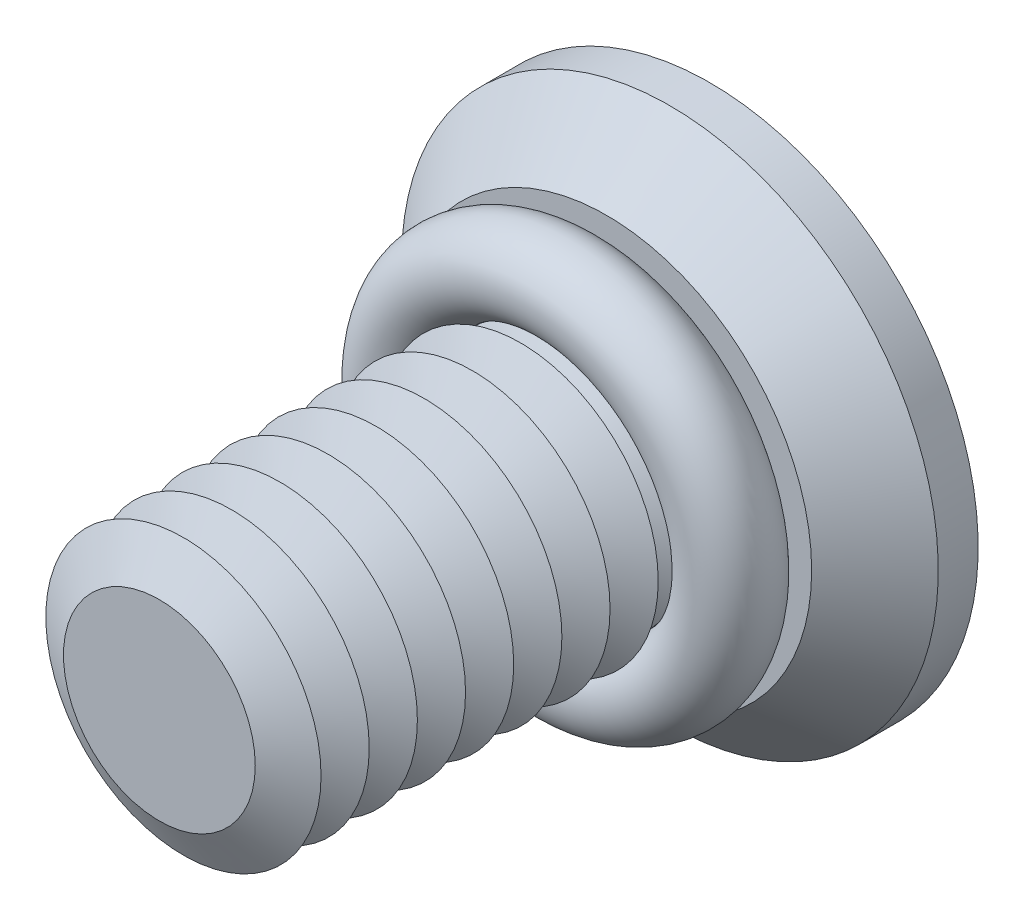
ISO-10303-21;
HEADER;
FILE_DESCRIPTION(('STEP AP214'),'2;1');
FILE_NAME('part.step','',(''),(''),'','','');
FILE_SCHEMA(('AUTOMOTIVE_DESIGN { 1 0 10303 214 1 1 1 1 }'));
ENDSEC;
DATA;
#1=APPLICATION_CONTEXT('core data for automotive mechanical design processes');
#2=APPLICATION_PROTOCOL_DEFINITION('international standard','automotive_design',2000,#1);
#3=PRODUCT_CONTEXT('',#1,'mechanical');
#4=PRODUCT('Part','Part','',(#3));
#5=PRODUCT_RELATED_PRODUCT_CATEGORY('part','',(#4));
#6=PRODUCT_DEFINITION_FORMATION('','',#4);
#7=PRODUCT_DEFINITION_CONTEXT('part definition',#1,'design');
#8=PRODUCT_DEFINITION('design','',#6,#7);
#9=PRODUCT_DEFINITION_SHAPE('','',#8);
#10=(LENGTH_UNIT() NAMED_UNIT(*) SI_UNIT(.MILLI.,.METRE.));
#11=(NAMED_UNIT(*) PLANE_ANGLE_UNIT() SI_UNIT($,.RADIAN.));
#12=(NAMED_UNIT(*) SI_UNIT($,.STERADIAN.) SOLID_ANGLE_UNIT());
#13=UNCERTAINTY_MEASURE_WITH_UNIT(LENGTH_MEASURE(1.E-05),#10,'distance_accuracy_value','');
#14=(GEOMETRIC_REPRESENTATION_CONTEXT(3) GLOBAL_UNCERTAINTY_ASSIGNED_CONTEXT((#13)) GLOBAL_UNIT_ASSIGNED_CONTEXT((#10,
#11,#12)) REPRESENTATION_CONTEXT('',''));
#15=CARTESIAN_POINT('',(0.,0.,0.));
#16=DIRECTION('',(0.,0.,1.));
#17=DIRECTION('',(1.,0.,0.));
#18=AXIS2_PLACEMENT_3D('',#15,#16,#17);
#19=CARTESIAN_POINT('',(0.,0.,2.1));
#20=DIRECTION('',(0.,0.,1.));
#21=DIRECTION('',(1.,0.,0.));
#22=AXIS2_PLACEMENT_3D('',#19,#20,#21);
#23=TOROIDAL_SURFACE('',#22,2.4,0.6);
#24=CARTESIAN_POINT('',(0.,2.4,2.1));
#25=DIRECTION('',(1.,0.,0.));
#26=DIRECTION('',(0.,0.,-1.));
#27=AXIS2_PLACEMENT_3D('',#24,#25,#26);
#28=CIRCLE('',#27,0.6);
#29=CARTESIAN_POINT('',(0.,3.,2.1));
#30=VERTEX_POINT('',#29);
#31=EDGE_CURVE('P0_E10',#30,#30,#28,.T.);
#32=CARTESIAN_POINT('',(0.,0.,2.1));
#33=DIRECTION('',(0.,0.,1.));
#34=DIRECTION('',(1.,0.,0.));
#35=AXIS2_PLACEMENT_3D('',#32,#33,#34);
#36=CIRCLE('',#35,3.);
#37=EDGE_CURVE('',#30,#30,#36,.T.);
#38=ORIENTED_EDGE('',*,*,#31,.F.);
#39=ORIENTED_EDGE('',*,*,#31,.T.);
#40=ORIENTED_EDGE('',*,*,#37,.T.);
#41=ORIENTED_EDGE('',*,*,#37,.F.);
#42=EDGE_LOOP('',(#38,#40,#39,#41));
#43=FACE_BOUND('',#42,.T.);
#44=ADVANCED_FACE('P0_F14',(#43),#23,.T.);
#45=CLOSED_SHELL('',(#44));
#46=MANIFOLD_SOLID_BREP('P0_B1',#45);
#47=CARTESIAN_POINT('',(0.,0.,4.5));
#48=DIRECTION('',(0.,0.,-1.));
#49=DIRECTION('',(-1.,0.,0.));
#50=AXIS2_PLACEMENT_3D('',#47,#48,#49);
#51=CONICAL_SURFACE('',#50,1.39378221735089,1.0471975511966);
#52=CARTESIAN_POINT('',(0.,0.,4.15));
#53=DIRECTION('',(0.,0.,1.));
#54=DIRECTION('',(1.,0.,0.));
#55=AXIS2_PLACEMENT_3D('',#52,#53,#54);
#56=CIRCLE('',#55,2.);
#57=CARTESIAN_POINT('',(2.,0.,4.15));
#58=VERTEX_POINT('',#57);
#59=EDGE_CURVE('P1_E324',#58,#58,#56,.T.);
#60=ORIENTED_EDGE('',*,*,#59,.T.);
#61=EDGE_LOOP('',(#60));
#62=FACE_BOUND('',#61,.T.);
#63=CARTESIAN_POINT('',(0.,0.,4.5));
#64=DIRECTION('',(0.,0.,1.));
#65=DIRECTION('',(1.,0.,0.));
#66=AXIS2_PLACEMENT_3D('',#63,#64,#65);
#67=CIRCLE('',#66,1.39378221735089);
#68=CARTESIAN_POINT('',(1.39378221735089,0.,4.5));
#69=VERTEX_POINT('',#68);
#70=EDGE_CURVE('P1_E321',#69,#69,#67,.T.);
#71=ORIENTED_EDGE('',*,*,#70,.F.);
#72=EDGE_LOOP('',(#71));
#73=FACE_BOUND('',#72,.T.);
#74=ADVANCED_FACE('P1_F15',(#62,#73),#51,.T.);
#75=CARTESIAN_POINT('',(0.,0.,4.85));
#76=DIRECTION('',(0.,0.,1.));
#77=DIRECTION('',(1.,0.,0.));
#78=AXIS2_PLACEMENT_3D('',#75,#76,#77);
#79=CONICAL_SURFACE('',#78,2.,1.0471975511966);
#80=ORIENTED_EDGE('',*,*,#70,.T.);
#81=EDGE_LOOP('',(#80));
#82=FACE_BOUND('',#81,.T.);
#83=CARTESIAN_POINT('',(0.,0.,4.85));
#84=DIRECTION('',(0.,0.,1.));
#85=DIRECTION('',(1.,0.,0.));
#86=AXIS2_PLACEMENT_3D('',#83,#84,#85);
#87=CIRCLE('',#86,2.);
#88=CARTESIAN_POINT('',(2.,0.,4.85));
#89=VERTEX_POINT('',#88);
#90=EDGE_CURVE('P1_E318',#89,#89,#87,.T.);
#91=ORIENTED_EDGE('',*,*,#90,.F.);
#92=EDGE_LOOP('',(#91));
#93=FACE_BOUND('',#92,.T.);
#94=ADVANCED_FACE('P1_F245',(#82,#93),#79,.T.);
#95=CARTESIAN_POINT('',(0.,0.,8.));
#96=DIRECTION('',(0.,0.,1.));
#97=DIRECTION('',(1.,0.,0.));
#98=AXIS2_PLACEMENT_3D('',#95,#96,#97);
#99=PLANE('',#98);
#100=CARTESIAN_POINT('',(0.,0.,8.));
#101=DIRECTION('',(0.,0.,1.));
#102=DIRECTION('',(1.,0.,0.));
#103=AXIS2_PLACEMENT_3D('',#100,#101,#102);
#104=CIRCLE('',#103,1.39378221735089);
#105=CARTESIAN_POINT('',(1.39378221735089,0.,8.));
#106=VERTEX_POINT('',#105);
#107=EDGE_CURVE('P1_E131',#106,#106,#104,.T.);
#108=ORIENTED_EDGE('',*,*,#107,.T.);
#109=EDGE_LOOP('',(#108));
#110=FACE_BOUND('',#109,.T.);
#111=ADVANCED_FACE('P1_F251',(#110),#99,.T.);
#112=CARTESIAN_POINT('',(0.,0.,8.));
#113=DIRECTION('',(0.,0.,-1.));
#114=DIRECTION('',(-1.,0.,0.));
#115=AXIS2_PLACEMENT_3D('',#112,#113,#114);
#116=CONICAL_SURFACE('',#115,1.39378221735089,1.0471975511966);
#117=CARTESIAN_POINT('',(0.,0.,7.65));
#118=DIRECTION('',(0.,0.,1.));
#119=DIRECTION('',(1.,0.,0.));
#120=AXIS2_PLACEMENT_3D('',#117,#118,#119);
#121=CIRCLE('',#120,2.);
#122=CARTESIAN_POINT('',(2.,0.,7.65));
#123=VERTEX_POINT('',#122);
#124=EDGE_CURVE('P1_E133',#123,#123,#121,.T.);
#125=ORIENTED_EDGE('',*,*,#124,.T.);
#126=EDGE_LOOP('',(#125));
#127=FACE_BOUND('',#126,.T.);
#128=ORIENTED_EDGE('',*,*,#107,.F.);
#129=EDGE_LOOP('',(#128));
#130=FACE_BOUND('',#129,.T.);
#131=ADVANCED_FACE('P1_F196',(#127,#130),#116,.T.);
#132=CARTESIAN_POINT('',(0.,0.,7.65));
#133=DIRECTION('',(0.,0.,1.));
#134=DIRECTION('',(1.,0.,0.));
#135=AXIS2_PLACEMENT_3D('',#132,#133,#134);
#136=CONICAL_SURFACE('',#135,2.,1.0471975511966);
#137=CARTESIAN_POINT('',(0.,0.,7.3));
#138=DIRECTION('',(0.,0.,1.));
#139=DIRECTION('',(1.,0.,0.));
#140=AXIS2_PLACEMENT_3D('',#137,#138,#139);
#141=CIRCLE('',#140,1.39378221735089);
#142=CARTESIAN_POINT('',(1.39378221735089,0.,7.3));
#143=VERTEX_POINT('',#142);
#144=EDGE_CURVE('P1_E297',#143,#143,#141,.T.);
#145=ORIENTED_EDGE('',*,*,#144,.T.);
#146=EDGE_LOOP('',(#145));
#147=FACE_BOUND('',#146,.T.);
#148=ORIENTED_EDGE('',*,*,#124,.F.);
#149=EDGE_LOOP('',(#148));
#150=FACE_BOUND('',#149,.T.);
#151=ADVANCED_FACE('P1_F284',(#147,#150),#136,.T.);
#152=CARTESIAN_POINT('',(0.,0.,7.3));
#153=DIRECTION('',(0.,0.,-1.));
#154=DIRECTION('',(-1.,0.,0.));
#155=AXIS2_PLACEMENT_3D('',#152,#153,#154);
#156=CONICAL_SURFACE('',#155,1.39378221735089,1.0471975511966);
#157=CARTESIAN_POINT('',(0.,0.,6.95));
#158=DIRECTION('',(0.,0.,1.));
#159=DIRECTION('',(1.,0.,0.));
#160=AXIS2_PLACEMENT_3D('',#157,#158,#159);
#161=CIRCLE('',#160,2.);
#162=CARTESIAN_POINT('',(2.,0.,6.95));
#163=VERTEX_POINT('',#162);
#164=EDGE_CURVE('P1_E294',#163,#163,#161,.T.);
#165=ORIENTED_EDGE('',*,*,#164,.T.);
#166=EDGE_LOOP('',(#165));
#167=FACE_BOUND('',#166,.T.);
#168=ORIENTED_EDGE('',*,*,#144,.F.);
#169=EDGE_LOOP('',(#168));
#170=FACE_BOUND('',#169,.T.);
#171=ADVANCED_FACE('P1_F279',(#167,#170),#156,.T.);
#172=CARTESIAN_POINT('',(0.,0.,6.95));
#173=DIRECTION('',(0.,0.,1.));
#174=DIRECTION('',(1.,0.,0.));
#175=AXIS2_PLACEMENT_3D('',#172,#173,#174);
#176=CONICAL_SURFACE('',#175,2.,1.0471975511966);
#177=CARTESIAN_POINT('',(0.,0.,6.6));
#178=DIRECTION('',(0.,0.,1.));
#179=DIRECTION('',(1.,0.,0.));
#180=AXIS2_PLACEMENT_3D('',#177,#178,#179);
#181=CIRCLE('',#180,1.39378221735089);
#182=CARTESIAN_POINT('',(1.39378221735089,0.,6.6));
#183=VERTEX_POINT('',#182);
#184=EDGE_CURVE('P1_E301',#183,#183,#181,.T.);
#185=ORIENTED_EDGE('',*,*,#184,.T.);
#186=EDGE_LOOP('',(#185));
#187=FACE_BOUND('',#186,.T.);
#188=ORIENTED_EDGE('',*,*,#164,.F.);
#189=EDGE_LOOP('',(#188));
#190=FACE_BOUND('',#189,.T.);
#191=ADVANCED_FACE('P1_F276',(#187,#190),#176,.T.);
#192=CARTESIAN_POINT('',(0.,0.,6.6));
#193=DIRECTION('',(0.,0.,-1.));
#194=DIRECTION('',(-1.,0.,0.));
#195=AXIS2_PLACEMENT_3D('',#192,#193,#194);
#196=CONICAL_SURFACE('',#195,1.39378221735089,1.0471975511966);
#197=CARTESIAN_POINT('',(0.,0.,6.25));
#198=DIRECTION('',(0.,0.,1.));
#199=DIRECTION('',(1.,0.,0.));
#200=AXIS2_PLACEMENT_3D('',#197,#198,#199);
#201=CIRCLE('',#200,2.);
#202=CARTESIAN_POINT('',(2.,0.,6.25));
#203=VERTEX_POINT('',#202);
#204=EDGE_CURVE('P1_E306',#203,#203,#201,.T.);
#205=ORIENTED_EDGE('',*,*,#204,.T.);
#206=EDGE_LOOP('',(#205));
#207=FACE_BOUND('',#206,.T.);
#208=ORIENTED_EDGE('',*,*,#184,.F.);
#209=EDGE_LOOP('',(#208));
#210=FACE_BOUND('',#209,.T.);
#211=ADVANCED_FACE('P1_F271',(#207,#210),#196,.T.);
#212=CARTESIAN_POINT('',(0.,0.,6.25));
#213=DIRECTION('',(0.,0.,1.));
#214=DIRECTION('',(1.,0.,0.));
#215=AXIS2_PLACEMENT_3D('',#212,#213,#214);
#216=CONICAL_SURFACE('',#215,2.,1.0471975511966);
#217=CARTESIAN_POINT('',(0.,0.,5.9));
#218=DIRECTION('',(0.,0.,1.));
#219=DIRECTION('',(1.,0.,0.));
#220=AXIS2_PLACEMENT_3D('',#217,#218,#219);
#221=CIRCLE('',#220,1.39378221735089);
#222=CARTESIAN_POINT('',(1.39378221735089,0.,5.9));
#223=VERTEX_POINT('',#222);
#224=EDGE_CURVE('P1_E309',#223,#223,#221,.T.);
#225=ORIENTED_EDGE('',*,*,#224,.T.);
#226=EDGE_LOOP('',(#225));
#227=FACE_BOUND('',#226,.T.);
#228=ORIENTED_EDGE('',*,*,#204,.F.);
#229=EDGE_LOOP('',(#228));
#230=FACE_BOUND('',#229,.T.);
#231=ADVANCED_FACE('P1_F268',(#227,#230),#216,.T.);
#232=CARTESIAN_POINT('',(0.,0.,5.9));
#233=DIRECTION('',(0.,0.,-1.));
#234=DIRECTION('',(-1.,0.,0.));
#235=AXIS2_PLACEMENT_3D('',#232,#233,#234);
#236=CONICAL_SURFACE('',#235,1.39378221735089,1.0471975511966);
#237=CARTESIAN_POINT('',(0.,0.,5.55));
#238=DIRECTION('',(0.,0.,1.));
#239=DIRECTION('',(1.,0.,0.));
#240=AXIS2_PLACEMENT_3D('',#237,#238,#239);
#241=CIRCLE('',#240,2.);
#242=CARTESIAN_POINT('',(2.,0.,5.55));
#243=VERTEX_POINT('',#242);
#244=EDGE_CURVE('P1_E312',#243,#243,#241,.T.);
#245=ORIENTED_EDGE('',*,*,#244,.T.);
#246=EDGE_LOOP('',(#245));
#247=FACE_BOUND('',#246,.T.);
#248=ORIENTED_EDGE('',*,*,#224,.F.);
#249=EDGE_LOOP('',(#248));
#250=FACE_BOUND('',#249,.T.);
#251=ADVANCED_FACE('P1_F262',(#247,#250),#236,.T.);
#252=CARTESIAN_POINT('',(0.,0.,5.55));
#253=DIRECTION('',(0.,0.,1.));
#254=DIRECTION('',(1.,0.,0.));
#255=AXIS2_PLACEMENT_3D('',#252,#253,#254);
#256=CONICAL_SURFACE('',#255,2.,1.0471975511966);
#257=CARTESIAN_POINT('',(0.,0.,5.2));
#258=DIRECTION('',(0.,0.,1.));
#259=DIRECTION('',(1.,0.,0.));
#260=AXIS2_PLACEMENT_3D('',#257,#258,#259);
#261=CIRCLE('',#260,1.39378221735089);
#262=CARTESIAN_POINT('',(1.39378221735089,0.,5.2));
#263=VERTEX_POINT('',#262);
#264=EDGE_CURVE('P1_E315',#263,#263,#261,.T.);
#265=ORIENTED_EDGE('',*,*,#264,.T.);
#266=EDGE_LOOP('',(#265));
#267=FACE_BOUND('',#266,.T.);
#268=ORIENTED_EDGE('',*,*,#244,.F.);
#269=EDGE_LOOP('',(#268));
#270=FACE_BOUND('',#269,.T.);
#271=ADVANCED_FACE('P1_F258',(#267,#270),#256,.T.);
#272=CARTESIAN_POINT('',(0.,0.,5.2));
#273=DIRECTION('',(0.,0.,-1.));
#274=DIRECTION('',(-1.,0.,0.));
#275=AXIS2_PLACEMENT_3D('',#272,#273,#274);
#276=CONICAL_SURFACE('',#275,1.39378221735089,1.0471975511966);
#277=ORIENTED_EDGE('',*,*,#90,.T.);
#278=EDGE_LOOP('',(#277));
#279=FACE_BOUND('',#278,.T.);
#280=ORIENTED_EDGE('',*,*,#264,.F.);
#281=EDGE_LOOP('',(#280));
#282=FACE_BOUND('',#281,.T.);
#283=ADVANCED_FACE('P1_F261',(#279,#282),#276,.T.);
#284=CARTESIAN_POINT('',(0.,0.,3.8));
#285=DIRECTION('',(0.,0.,-1.));
#286=DIRECTION('',(-1.,0.,0.));
#287=AXIS2_PLACEMENT_3D('',#284,#285,#286);
#288=CONICAL_SURFACE('',#287,1.39378221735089,1.0471975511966);
#289=CARTESIAN_POINT('',(0.,0.,3.45));
#290=DIRECTION('',(0.,0.,1.));
#291=DIRECTION('',(1.,0.,0.));
#292=AXIS2_PLACEMENT_3D('',#289,#290,#291);
#293=CIRCLE('',#292,2.);
#294=CARTESIAN_POINT('',(2.,0.,3.45));
#295=VERTEX_POINT('',#294);
#296=EDGE_CURVE('P1_E329',#295,#295,#293,.T.);
#297=ORIENTED_EDGE('',*,*,#296,.T.);
#298=EDGE_LOOP('',(#297));
#299=FACE_BOUND('',#298,.T.);
#300=CARTESIAN_POINT('',(0.,0.,3.8));
#301=DIRECTION('',(0.,0.,1.));
#302=DIRECTION('',(1.,0.,0.));
#303=AXIS2_PLACEMENT_3D('',#300,#301,#302);
#304=CIRCLE('',#303,1.39378221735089);
#305=CARTESIAN_POINT('',(1.39378221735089,0.,3.8));
#306=VERTEX_POINT('',#305);
#307=EDGE_CURVE('P1_E326',#306,#306,#304,.T.);
#308=ORIENTED_EDGE('',*,*,#307,.F.);
#309=EDGE_LOOP('',(#308));
#310=FACE_BOUND('',#309,.T.);
#311=ADVANCED_FACE('P1_F266',(#299,#310),#288,.T.);
#312=CARTESIAN_POINT('',(0.,0.,4.15));
#313=DIRECTION('',(0.,0.,1.));
#314=DIRECTION('',(1.,0.,0.));
#315=AXIS2_PLACEMENT_3D('',#312,#313,#314);
#316=CONICAL_SURFACE('',#315,2.,1.0471975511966);
#317=ORIENTED_EDGE('',*,*,#307,.T.);
#318=EDGE_LOOP('',(#317));
#319=FACE_BOUND('',#318,.T.);
#320=ORIENTED_EDGE('',*,*,#59,.F.);
#321=EDGE_LOOP('',(#320));
#322=FACE_BOUND('',#321,.T.);
#323=ADVANCED_FACE('P1_F444',(#319,#322),#316,.T.);
#324=CARTESIAN_POINT('',(0.,0.,3.1));
#325=DIRECTION('',(0.,0.,-1.));
#326=DIRECTION('',(-1.,0.,0.));
#327=AXIS2_PLACEMENT_3D('',#324,#325,#326);
#328=CONICAL_SURFACE('',#327,1.39378221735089,1.0471975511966);
#329=CARTESIAN_POINT('',(0.,0.,2.75));
#330=DIRECTION('',(0.,0.,1.));
#331=DIRECTION('',(1.,0.,0.));
#332=AXIS2_PLACEMENT_3D('',#329,#330,#331);
#333=CIRCLE('',#332,2.);
#334=CARTESIAN_POINT('',(2.,0.,2.75));
#335=VERTEX_POINT('',#334);
#336=EDGE_CURVE('P1_E335',#335,#335,#333,.T.);
#337=ORIENTED_EDGE('',*,*,#336,.T.);
#338=EDGE_LOOP('',(#337));
#339=FACE_BOUND('',#338,.T.);
#340=CARTESIAN_POINT('',(0.,0.,3.1));
#341=DIRECTION('',(0.,0.,1.));
#342=DIRECTION('',(1.,0.,0.));
#343=AXIS2_PLACEMENT_3D('',#340,#341,#342);
#344=CIRCLE('',#343,1.39378221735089);
#345=CARTESIAN_POINT('',(1.39378221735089,0.,3.1));
#346=VERTEX_POINT('',#345);
#347=EDGE_CURVE('P1_E332',#346,#346,#344,.T.);
#348=ORIENTED_EDGE('',*,*,#347,.F.);
#349=EDGE_LOOP('',(#348));
#350=FACE_BOUND('',#349,.T.);
#351=ADVANCED_FACE('P1_F454',(#339,#350),#328,.T.);
#352=CARTESIAN_POINT('',(0.,0.,3.45));
#353=DIRECTION('',(0.,0.,1.));
#354=DIRECTION('',(1.,0.,0.));
#355=AXIS2_PLACEMENT_3D('',#352,#353,#354);
#356=CONICAL_SURFACE('',#355,2.,1.0471975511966);
#357=ORIENTED_EDGE('',*,*,#347,.T.);
#358=EDGE_LOOP('',(#357));
#359=FACE_BOUND('',#358,.T.);
#360=ORIENTED_EDGE('',*,*,#296,.F.);
#361=EDGE_LOOP('',(#360));
#362=FACE_BOUND('',#361,.T.);
#363=ADVANCED_FACE('P1_F348',(#359,#362),#356,.T.);
#364=CARTESIAN_POINT('',(0.,0.,2.4));
#365=DIRECTION('',(0.,0.,-1.));
#366=DIRECTION('',(-1.,0.,0.));
#367=AXIS2_PLACEMENT_3D('',#364,#365,#366);
#368=CONICAL_SURFACE('',#367,1.39378221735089,1.0471975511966);
#369=CARTESIAN_POINT('',(0.,0.,2.4));
#370=DIRECTION('',(0.,0.,1.));
#371=DIRECTION('',(1.,0.,0.));
#372=AXIS2_PLACEMENT_3D('',#369,#370,#371);
#373=CIRCLE('',#372,1.39378221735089);
#374=CARTESIAN_POINT('',(1.39378221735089,0.,2.4));
#375=VERTEX_POINT('',#374);
#376=EDGE_CURVE('P1_E338',#375,#375,#373,.T.);
#377=ORIENTED_EDGE('',*,*,#376,.F.);
#378=EDGE_LOOP('',(#377));
#379=FACE_BOUND('',#378,.T.);
#380=CARTESIAN_POINT('',(0.,0.,2.16547005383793));
#381=DIRECTION('',(0.,0.,-1.));
#382=DIRECTION('',(-1.,0.,0.));
#383=AXIS2_PLACEMENT_3D('',#380,#381,#382);
#384=CIRCLE('',#383,1.8);
#385=CARTESIAN_POINT('',(-1.8,0.,2.16547005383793));
#386=VERTEX_POINT('',#385);
#387=EDGE_CURVE('P1_E19',#386,#386,#384,.F.);
#388=ORIENTED_EDGE('',*,*,#387,.T.);
#389=EDGE_LOOP('',(#388));
#390=FACE_BOUND('',#389,.T.);
#391=ADVANCED_FACE('P1_F345',(#379,#390),#368,.T.);
#392=CARTESIAN_POINT('',(0.,0.,2.75));
#393=DIRECTION('',(0.,0.,1.));
#394=DIRECTION('',(1.,0.,0.));
#395=AXIS2_PLACEMENT_3D('',#392,#393,#394);
#396=CONICAL_SURFACE('',#395,2.,1.0471975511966);
#397=ORIENTED_EDGE('',*,*,#376,.T.);
#398=EDGE_LOOP('',(#397));
#399=FACE_BOUND('',#398,.T.);
#400=ORIENTED_EDGE('',*,*,#336,.F.);
#401=EDGE_LOOP('',(#400));
#402=FACE_BOUND('',#401,.T.);
#403=ADVANCED_FACE('P1_F342',(#399,#402),#396,.T.);
#404=CARTESIAN_POINT('',(0.,0.,1.5));
#405=DIRECTION('',(0.,0.,-1.));
#406=DIRECTION('',(-1.,0.,0.));
#407=AXIS2_PLACEMENT_3D('',#404,#405,#406);
#408=CONICAL_SURFACE('',#407,1.25,1.0471975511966);
#409=CARTESIAN_POINT('',(0.,0.,2.22168783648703));
#410=VERTEX_POINT('',#409);
#411=VERTEX_LOOP('',#410);
#412=FACE_BOUND('',#411,.T.);
#413=CARTESIAN_POINT('',(0.,0.,1.5));
#414=DIRECTION('',(0.,0.,-1.));
#415=DIRECTION('',(-1.,0.,0.));
#416=AXIS2_PLACEMENT_3D('',#413,#414,#415);
#417=CIRCLE('',#416,1.25);
#418=CARTESIAN_POINT('',(-1.25,0.,1.5));
#419=VERTEX_POINT('',#418);
#420=CARTESIAN_POINT('',(-0.625,1.08253175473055,1.5));
#421=VERTEX_POINT('',#420);
#422=EDGE_CURVE('P1_E117',#419,#421,#417,.T.);
#423=ORIENTED_EDGE('',*,*,#422,.T.);
#424=CARTESIAN_POINT('',(0.,0.,1.5));
#425=DIRECTION('',(0.,0.,-1.));
#426=DIRECTION('',(-1.,0.,0.));
#427=AXIS2_PLACEMENT_3D('',#424,#425,#426);
#428=CIRCLE('',#427,1.25);
#429=CARTESIAN_POINT('',(0.625,1.08253175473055,1.5));
#430=VERTEX_POINT('',#429);
#431=EDGE_CURVE('P1_E24',#421,#430,#428,.T.);
#432=ORIENTED_EDGE('',*,*,#431,.T.);
#433=CARTESIAN_POINT('',(1.25,0.,1.5));
#434=VERTEX_POINT('',#433);
#435=EDGE_CURVE('P1_E687',#430,#434,#428,.T.);
#436=ORIENTED_EDGE('',*,*,#435,.T.);
#437=CARTESIAN_POINT('',(0.625,-1.08253175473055,1.5));
#438=VERTEX_POINT('',#437);
#439=EDGE_CURVE('P1_E680',#434,#438,#428,.T.);
#440=ORIENTED_EDGE('',*,*,#439,.T.);
#441=CARTESIAN_POINT('',(-0.625,-1.08253175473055,1.5));
#442=VERTEX_POINT('',#441);
#443=EDGE_CURVE('P1_E182',#438,#442,#428,.T.);
#444=ORIENTED_EDGE('',*,*,#443,.T.);
#445=EDGE_CURVE('P1_E179',#442,#419,#428,.T.);
#446=ORIENTED_EDGE('',*,*,#445,.T.);
#447=EDGE_LOOP('',(#423,#432,#436,#440,#444,#446));
#448=FACE_BOUND('',#447,.T.);
#449=ADVANCED_FACE('P1_F198',(#412,#448),#408,.F.);
#450=CARTESIAN_POINT('',(0.,0.,1.5));
#451=DIRECTION('',(0.,0.,-1.));
#452=DIRECTION('',(-1.,0.,0.));
#453=AXIS2_PLACEMENT_3D('',#450,#451,#452);
#454=PLANE('',#453);
#455=ORIENTED_EDGE('',*,*,#443,.F.);
#456=DIRECTION('',(-0.866025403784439,-0.5,0.));
#457=VECTOR('',#456,1.);
#458=CARTESIAN_POINT('',(1.25,-0.721687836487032,1.5));
#459=LINE('',#458,#457);
#460=CARTESIAN_POINT('',(0.,-1.44337567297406,1.5));
#461=VERTEX_POINT('',#460);
#462=EDGE_CURVE('P1_E696',#438,#461,#459,.T.);
#463=ORIENTED_EDGE('',*,*,#462,.T.);
#464=DIRECTION('',(-0.866025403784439,0.5,0.));
#465=VECTOR('',#464,1.);
#466=CARTESIAN_POINT('',(0.,-1.44337567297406,1.5));
#467=LINE('',#466,#465);
#468=EDGE_CURVE('P1_E703',#461,#442,#467,.T.);
#469=ORIENTED_EDGE('',*,*,#468,.T.);
#470=EDGE_LOOP('',(#455,#463,#469));
#471=FACE_BOUND('',#470,.T.);
#472=ADVANCED_FACE('P1_F496',(#471),#454,.T.);
#473=ORIENTED_EDGE('',*,*,#445,.F.);
#474=CARTESIAN_POINT('',(-1.25,-0.721687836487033,1.5));
#475=VERTEX_POINT('',#474);
#476=EDGE_CURVE('P1_E706',#442,#475,#467,.T.);
#477=ORIENTED_EDGE('',*,*,#476,.T.);
#478=DIRECTION('',(0.,1.,0.));
#479=VECTOR('',#478,1.);
#480=CARTESIAN_POINT('',(-1.25,-0.721687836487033,1.5));
#481=LINE('',#480,#479);
#482=EDGE_CURVE('P1_E123',#475,#419,#481,.T.);
#483=ORIENTED_EDGE('',*,*,#482,.T.);
#484=EDGE_LOOP('',(#473,#477,#483));
#485=FACE_BOUND('',#484,.T.);
#486=ADVANCED_FACE('P1_F231',(#485),#454,.T.);
#487=ORIENTED_EDGE('',*,*,#422,.F.);
#488=CARTESIAN_POINT('',(-1.25,0.721687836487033,1.5));
#489=VERTEX_POINT('',#488);
#490=EDGE_CURVE('P1_E708',#419,#489,#481,.T.);
#491=ORIENTED_EDGE('',*,*,#490,.T.);
#492=DIRECTION('',(0.866025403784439,0.5,0.));
#493=VECTOR('',#492,1.);
#494=CARTESIAN_POINT('',(-1.25,0.721687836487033,1.5));
#495=LINE('',#494,#493);
#496=EDGE_CURVE('P1_E711',#489,#421,#495,.T.);
#497=ORIENTED_EDGE('',*,*,#496,.T.);
#498=EDGE_LOOP('',(#487,#491,#497));
#499=FACE_BOUND('',#498,.T.);
#500=ADVANCED_FACE('P1_F513',(#499),#454,.T.);
#501=ORIENTED_EDGE('',*,*,#431,.F.);
#502=CARTESIAN_POINT('',(0.,1.44337567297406,1.5));
#503=VERTEX_POINT('',#502);
#504=EDGE_CURVE('P1_E710',#421,#503,#495,.T.);
#505=ORIENTED_EDGE('',*,*,#504,.T.);
#506=DIRECTION('',(0.866025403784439,-0.5,0.));
#507=VECTOR('',#506,1.);
#508=CARTESIAN_POINT('',(0.,1.44337567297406,1.5));
#509=LINE('',#508,#507);
#510=EDGE_CURVE('P1_E161',#503,#430,#509,.T.);
#511=ORIENTED_EDGE('',*,*,#510,.T.);
#512=EDGE_LOOP('',(#501,#505,#511));
#513=FACE_BOUND('',#512,.T.);
#514=ADVANCED_FACE('P1_F522',(#513),#454,.T.);
#515=ORIENTED_EDGE('',*,*,#435,.F.);
#516=CARTESIAN_POINT('',(1.25,0.721687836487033,1.5));
#517=VERTEX_POINT('',#516);
#518=EDGE_CURVE('P1_E695',#430,#517,#509,.T.);
#519=ORIENTED_EDGE('',*,*,#518,.T.);
#520=DIRECTION('',(0.,-1.,0.));
#521=VECTOR('',#520,1.);
#522=CARTESIAN_POINT('',(1.25,0.721687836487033,1.5));
#523=LINE('',#522,#521);
#524=EDGE_CURVE('P1_E690',#517,#434,#523,.T.);
#525=ORIENTED_EDGE('',*,*,#524,.T.);
#526=EDGE_LOOP('',(#515,#519,#525));
#527=FACE_BOUND('',#526,.T.);
#528=ADVANCED_FACE('P1_F531',(#527),#454,.T.);
#529=ORIENTED_EDGE('',*,*,#439,.F.);
#530=CARTESIAN_POINT('',(1.25,-0.721687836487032,1.5));
#531=VERTEX_POINT('',#530);
#532=EDGE_CURVE('P1_E682',#434,#531,#523,.T.);
#533=ORIENTED_EDGE('',*,*,#532,.T.);
#534=EDGE_CURVE('P1_E125',#531,#438,#459,.T.);
#535=ORIENTED_EDGE('',*,*,#534,.T.);
#536=EDGE_LOOP('',(#529,#533,#535));
#537=FACE_BOUND('',#536,.T.);
#538=ADVANCED_FACE('P1_F229',(#537),#454,.T.);
#539=CARTESIAN_POINT('',(1.25,-0.721687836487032,1.5));
#540=DIRECTION('',(0.5,-0.866025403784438,0.));
#541=DIRECTION('',(0.866025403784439,0.5,0.));
#542=AXIS2_PLACEMENT_3D('',#539,#540,#541);
#543=PLANE('',#542);
#544=DIRECTION('',(0.,0.,-1.));
#545=VECTOR('',#544,1.);
#546=CARTESIAN_POINT('',(1.25,-0.721687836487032,1.5));
#547=LINE('',#546,#545);
#548=CARTESIAN_POINT('',(1.25,-0.721687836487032,0.));
#549=VERTEX_POINT('',#548);
#550=EDGE_CURVE('P1_E164',#531,#549,#547,.T.);
#551=ORIENTED_EDGE('',*,*,#550,.T.);
#552=CARTESIAN_POINT('',(1.2502,-0.721572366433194,-3.09438201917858E-05));
#553=CARTESIAN_POINT('',(1.19827409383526,-0.75155180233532,0.00800698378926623));
#554=CARTESIAN_POINT('',(1.14625401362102,-0.781585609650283,0.0153042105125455));
#555=CARTESIAN_POINT('',(1.04203006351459,-0.841759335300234,0.028124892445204));
#556=CARTESIAN_POINT('',(0.989826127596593,-0.871899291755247,0.0336476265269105));
#557=CARTESIAN_POINT('',(0.88555111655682,-0.932102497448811,0.0425967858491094));
#558=CARTESIAN_POINT('',(0.833480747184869,-0.96216533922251,0.0460338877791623));
#559=CARTESIAN_POINT('',(0.729273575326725,-1.0223293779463,0.0506427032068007));
#560=CARTESIAN_POINT('',(0.677136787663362,-1.05243056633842,0.0518148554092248));
#561=CARTESIAN_POINT('',(0.572863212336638,-1.11263294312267,0.0518148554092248));
#562=CARTESIAN_POINT('',(0.520726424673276,-1.1427341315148,0.0506427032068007));
#563=CARTESIAN_POINT('',(0.416519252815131,-1.20289817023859,0.0460338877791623));
#564=CARTESIAN_POINT('',(0.36444888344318,-1.23296101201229,0.0425967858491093));
#565=CARTESIAN_POINT('',(0.260173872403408,-1.29316421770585,0.0336476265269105));
#566=CARTESIAN_POINT('',(0.207969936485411,-1.32330417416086,0.028124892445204));
#567=CARTESIAN_POINT('',(0.103745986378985,-1.38347789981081,0.0153042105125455));
#568=CARTESIAN_POINT('',(0.0517259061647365,-1.41351170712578,0.00800698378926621));
#569=CARTESIAN_POINT('',(-0.000199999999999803,-1.4434911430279,-3.09438201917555E-05));
#570=B_SPLINE_CURVE_WITH_KNOTS('',3,(#552,#553,#554,#555,#556,#557,#558,#559,#560,#561,#562,
#563,#564,#565,#566,#567,#568,#569),.UNSPECIFIED.,.F.,.F.,(4,2,2,2,2,2,2,2,4),(0.,
0.18149525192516,0.363064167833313,0.543695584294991,0.724292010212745,0.904888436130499,
1.08551985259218,1.26708876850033,1.44858402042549),.UNSPECIFIED.);
#571=CARTESIAN_POINT('',(0.,-1.44337567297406,0.));
#572=VERTEX_POINT('',#571);
#573=EDGE_CURVE('P1_E118',#549,#572,#570,.T.);
#574=ORIENTED_EDGE('',*,*,#573,.T.);
#575=DIRECTION('',(0.,0.,-1.));
#576=VECTOR('',#575,1.);
#577=CARTESIAN_POINT('',(0.,-1.44337567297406,1.5));
#578=LINE('',#577,#576);
#579=EDGE_CURVE('P1_E116',#461,#572,#578,.T.);
#580=ORIENTED_EDGE('',*,*,#579,.F.);
#581=ORIENTED_EDGE('',*,*,#462,.F.);
#582=ORIENTED_EDGE('',*,*,#534,.F.);
#583=EDGE_LOOP('',(#551,#574,#580,#581,#582));
#584=FACE_BOUND('',#583,.T.);
#585=ADVANCED_FACE('P1_F226',(#584),#543,.F.);
#586=CARTESIAN_POINT('',(0.,-1.44337567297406,1.5));
#587=DIRECTION('',(-0.5,-0.866025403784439,0.));
#588=DIRECTION('',(0.866025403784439,-0.5,0.));
#589=AXIS2_PLACEMENT_3D('',#586,#587,#588);
#590=PLANE('',#589);
#591=ORIENTED_EDGE('',*,*,#579,.T.);
#592=CARTESIAN_POINT('',(0.000200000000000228,-1.4434911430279,-3.094382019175E-05));
#593=CARTESIAN_POINT('',(-0.0517259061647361,-1.41351170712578,0.00800698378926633));
#594=CARTESIAN_POINT('',(-0.103745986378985,-1.38347789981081,0.0153042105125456));
#595=CARTESIAN_POINT('',(-0.207969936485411,-1.32330417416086,0.028124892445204));
#596=CARTESIAN_POINT('',(-0.260173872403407,-1.29316421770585,0.0336476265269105));
#597=CARTESIAN_POINT('',(-0.36444888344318,-1.23296101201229,0.0425967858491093));
#598=CARTESIAN_POINT('',(-0.416519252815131,-1.20289817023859,0.0460338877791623));
#599=CARTESIAN_POINT('',(-0.520726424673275,-1.1427341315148,0.0506427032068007));
#600=CARTESIAN_POINT('',(-0.572863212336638,-1.11263294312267,0.0518148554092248));
#601=CARTESIAN_POINT('',(-0.677136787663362,-1.05243056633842,0.0518148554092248));
#602=CARTESIAN_POINT('',(-0.729273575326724,-1.0223293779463,0.0506427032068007));
#603=CARTESIAN_POINT('',(-0.833480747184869,-0.96216533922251,0.0460338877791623));
#604=CARTESIAN_POINT('',(-0.88555111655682,-0.932102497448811,0.0425967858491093));
#605=CARTESIAN_POINT('',(-0.989826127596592,-0.871899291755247,0.0336476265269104));
#606=CARTESIAN_POINT('',(-1.04203006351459,-0.841759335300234,0.028124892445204));
#607=CARTESIAN_POINT('',(-1.14625401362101,-0.781585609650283,0.0153042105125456));
#608=CARTESIAN_POINT('',(-1.19827409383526,-0.751551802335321,0.00800698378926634));
#609=CARTESIAN_POINT('',(-1.2502,-0.721572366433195,-3.09438201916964E-05));
#610=B_SPLINE_CURVE_WITH_KNOTS('',3,(#592,#593,#594,#595,#596,#597,#598,#599,#600,#601,#602,
#603,#604,#605,#606,#607,#608,#609),.UNSPECIFIED.,.F.,.F.,(4,2,2,2,2,2,2,2,4),(0.,
0.18149525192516,0.363064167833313,0.543695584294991,0.724292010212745,0.904888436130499,
1.08551985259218,1.26708876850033,1.44858402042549),.UNSPECIFIED.);
#611=CARTESIAN_POINT('',(-1.25,-0.721687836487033,0.));
#612=VERTEX_POINT('',#611);
#613=EDGE_CURVE('P1_E94',#572,#612,#610,.T.);
#614=ORIENTED_EDGE('',*,*,#613,.T.);
#615=DIRECTION('',(0.,0.,-1.));
#616=VECTOR('',#615,1.);
#617=CARTESIAN_POINT('',(-1.25,-0.721687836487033,1.5));
#618=LINE('',#617,#616);
#619=EDGE_CURVE('P1_E112',#475,#612,#618,.T.);
#620=ORIENTED_EDGE('',*,*,#619,.F.);
#621=ORIENTED_EDGE('',*,*,#476,.F.);
#622=ORIENTED_EDGE('',*,*,#468,.F.);
#623=EDGE_LOOP('',(#591,#614,#620,#621,#622));
#624=FACE_BOUND('',#623,.T.);
#625=ADVANCED_FACE('P1_F110',(#624),#590,.F.);
#626=CARTESIAN_POINT('',(-1.25,-0.721687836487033,1.5));
#627=DIRECTION('',(-1.,0.,0.));
#628=DIRECTION('',(0.,0.,1.));
#629=AXIS2_PLACEMENT_3D('',#626,#627,#628);
#630=PLANE('',#629);
#631=ORIENTED_EDGE('',*,*,#619,.T.);
#632=CARTESIAN_POINT('',(-1.25,-1.88400474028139,-0.219073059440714));
#633=CARTESIAN_POINT('',(-1.25,-1.82756112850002,-0.206472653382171));
#634=CARTESIAN_POINT('',(-1.25,-1.77108164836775,-0.194032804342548));
#635=CARTESIAN_POINT('',(-1.25,-1.65803301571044,-0.169555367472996));
#636=CARTESIAN_POINT('',(-1.25,-1.60146385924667,-0.157517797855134));
#637=CARTESIAN_POINT('',(-1.25,-1.43148763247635,-0.122107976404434));
#638=CARTESIAN_POINT('',(-1.25,-1.31792638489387,-0.0994645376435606));
#639=CARTESIAN_POINT('',(-1.25,-1.09123200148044,-0.057323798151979));
#640=CARTESIAN_POINT('',(-1.25,-0.978103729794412,-0.0378008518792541));
#641=CARTESIAN_POINT('',(-1.25,-0.751170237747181,-0.00320860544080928));
#642=CARTESIAN_POINT('',(-1.25,-0.637365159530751,0.0118615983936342));
#643=CARTESIAN_POINT('',(-1.25,-0.407744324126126,0.0355899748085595));
#644=CARTESIAN_POINT('',(-1.25,-0.291920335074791,0.0441742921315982));
#645=CARTESIAN_POINT('',(-1.25,-0.117976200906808,0.0506819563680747));
#646=CARTESIAN_POINT('',(-1.25,-0.059969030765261,0.0517900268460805));
#647=CARTESIAN_POINT('',(-1.25,0.0560463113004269,0.051838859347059));
#648=CARTESIAN_POINT('',(-1.25,0.114054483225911,0.0507796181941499));
#649=CARTESIAN_POINT('',(-1.25,0.288428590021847,0.0443978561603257));
#650=CARTESIAN_POINT('',(-1.25,0.404683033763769,0.0358543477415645));
#651=CARTESIAN_POINT('',(-1.25,0.63652474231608,0.0119999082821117));
#652=CARTESIAN_POINT('',(-1.25,0.752111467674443,-0.00331588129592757));
#653=CARTESIAN_POINT('',(-1.25,0.98558577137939,-0.0389793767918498));
#654=CARTESIAN_POINT('',(-1.25,1.10345418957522,-0.0594485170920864));
#655=CARTESIAN_POINT('',(-1.25,1.3386179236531,-0.10348104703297));
#656=CARTESIAN_POINT('',(-1.25,1.45591314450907,-0.127044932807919));
#657=CARTESIAN_POINT('',(-1.25,1.69011362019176,-0.176177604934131));
#658=CARTESIAN_POINT('',(-1.25,1.80701875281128,-0.201746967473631));
#659=CARTESIAN_POINT('',(-1.25,2.04053091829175,-0.254214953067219));
#660=CARTESIAN_POINT('',(-1.25,2.15713794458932,-0.281113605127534));
#661=CARTESIAN_POINT('',(-1.25,2.38871499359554,-0.335489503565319));
#662=CARTESIAN_POINT('',(-1.25,2.50368762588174,-0.362955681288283));
#663=CARTESIAN_POINT('',(-1.25,2.73348169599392,-0.418523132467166));
#664=CARTESIAN_POINT('',(-1.25,2.84830313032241,-0.446624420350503));
#665=CARTESIAN_POINT('',(-1.25,3.07767157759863,-0.503250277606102));
#666=CARTESIAN_POINT('',(-1.25,3.19221874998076,-0.531774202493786));
#667=CARTESIAN_POINT('',(-1.25,3.4212203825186,-0.589174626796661));
#668=CARTESIAN_POINT('',(-1.25,3.53567484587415,-0.618051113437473));
#669=CARTESIAN_POINT('',(-1.25,3.65009781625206,-0.647050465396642));
#670=B_SPLINE_CURVE_WITH_KNOTS('',3,(#632,#633,#634,#635,#636,#637,#638,#639,#640,#641,#642,
#643,#644,#645,#646,#647,#648,#649,#650,#651,#652,#653,#654,#655,#656,#657,#658,#659,#660,#661,
#662,#663,#664,#665,#666,#667,#668,#669),.UNSPECIFIED.,.F.,.F.,(4,2,2,2,2,2,2,2,2,2,2,2,2,2,2,2,
2,2,4),(0.,0.173498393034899,0.347004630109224,0.694369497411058,1.03871380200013,
1.38298817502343,1.73112607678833,1.90514173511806,2.07915764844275,2.42857002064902,
2.77823347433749,3.13706733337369,3.49595878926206,3.8549537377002,4.21395652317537,
4.56857767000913,4.92320688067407,5.27734186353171,5.63146405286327),.UNSPECIFIED.);
#671=CARTESIAN_POINT('',(-1.25,0.721687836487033,0.));
#672=VERTEX_POINT('',#671);
#673=EDGE_CURVE('P1_E10',#612,#672,#670,.T.);
#674=ORIENTED_EDGE('',*,*,#673,.T.);
#675=DIRECTION('',(0.,0.,-1.));
#676=VECTOR('',#675,1.);
#677=CARTESIAN_POINT('',(-1.25,0.721687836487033,1.5));
#678=LINE('',#677,#676);
#679=EDGE_CURVE('P1_E124',#489,#672,#678,.T.);
#680=ORIENTED_EDGE('',*,*,#679,.F.);
#681=ORIENTED_EDGE('',*,*,#490,.F.);
#682=ORIENTED_EDGE('',*,*,#482,.F.);
#683=EDGE_LOOP('',(#631,#674,#680,#681,#682));
#684=FACE_BOUND('',#683,.T.);
#685=ADVANCED_FACE('P1_F120',(#684),#630,.F.);
#686=CARTESIAN_POINT('',(-1.25,0.721687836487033,1.5));
#687=DIRECTION('',(-0.5,0.866025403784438,0.));
#688=DIRECTION('',(-0.866025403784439,-0.5,0.));
#689=AXIS2_PLACEMENT_3D('',#686,#687,#688);
#690=PLANE('',#689);
#691=ORIENTED_EDGE('',*,*,#679,.T.);
#692=CARTESIAN_POINT('',(-1.2502,0.721572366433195,-3.09438201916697E-05));
#693=CARTESIAN_POINT('',(-1.19827409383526,0.75155180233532,0.00800698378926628));
#694=CARTESIAN_POINT('',(-1.14625401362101,0.781585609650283,0.0153042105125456));
#695=CARTESIAN_POINT('',(-1.04203006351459,0.841759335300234,0.028124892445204));
#696=CARTESIAN_POINT('',(-0.989826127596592,0.871899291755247,0.0336476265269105));
#697=CARTESIAN_POINT('',(-0.88555111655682,0.932102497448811,0.0425967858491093));
#698=CARTESIAN_POINT('',(-0.833480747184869,0.96216533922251,0.0460338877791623));
#699=CARTESIAN_POINT('',(-0.729273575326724,1.0223293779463,0.0506427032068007));
#700=CARTESIAN_POINT('',(-0.677136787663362,1.05243056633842,0.0518148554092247));
#701=CARTESIAN_POINT('',(-0.572863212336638,1.11263294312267,0.0518148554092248));
#702=CARTESIAN_POINT('',(-0.520726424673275,1.1427341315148,0.0506427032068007));
#703=CARTESIAN_POINT('',(-0.416519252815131,1.20289817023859,0.0460338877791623));
#704=CARTESIAN_POINT('',(-0.36444888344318,1.23296101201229,0.0425967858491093));
#705=CARTESIAN_POINT('',(-0.260173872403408,1.29316421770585,0.0336476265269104));
#706=CARTESIAN_POINT('',(-0.207969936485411,1.32330417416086,0.0281248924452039));
#707=CARTESIAN_POINT('',(-0.103745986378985,1.38347789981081,0.0153042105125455));
#708=CARTESIAN_POINT('',(-0.0517259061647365,1.41351170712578,0.00800698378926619));
#709=CARTESIAN_POINT('',(0.000199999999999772,1.4434911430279,-3.09438201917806E-05));
#710=B_SPLINE_CURVE_WITH_KNOTS('',3,(#692,#693,#694,#695,#696,#697,#698,#699,#700,#701,#702,
#703,#704,#705,#706,#707,#708,#709),.UNSPECIFIED.,.F.,.F.,(4,2,2,2,2,2,2,2,4),(0.,
0.18149525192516,0.363064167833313,0.543695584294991,0.724292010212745,0.904888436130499,
1.08551985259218,1.26708876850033,1.44858402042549),.UNSPECIFIED.);
#711=CARTESIAN_POINT('',(0.,1.44337567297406,0.));
#712=VERTEX_POINT('',#711);
#713=EDGE_CURVE('P1_E136',#672,#712,#710,.T.);
#714=ORIENTED_EDGE('',*,*,#713,.T.);
#715=DIRECTION('',(0.,0.,-1.));
#716=VECTOR('',#715,1.);
#717=CARTESIAN_POINT('',(0.,1.44337567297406,1.5));
#718=LINE('',#717,#716);
#719=EDGE_CURVE('P1_E155',#503,#712,#718,.T.);
#720=ORIENTED_EDGE('',*,*,#719,.F.);
#721=ORIENTED_EDGE('',*,*,#504,.F.);
#722=ORIENTED_EDGE('',*,*,#496,.F.);
#723=EDGE_LOOP('',(#691,#714,#720,#721,#722));
#724=FACE_BOUND('',#723,.T.);
#725=ADVANCED_FACE('P1_F153',(#724),#690,.F.);
#726=CARTESIAN_POINT('',(0.,1.44337567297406,1.5));
#727=DIRECTION('',(0.5,0.866025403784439,0.));
#728=DIRECTION('',(-0.866025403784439,0.5,0.));
#729=AXIS2_PLACEMENT_3D('',#726,#727,#728);
#730=PLANE('',#729);
#731=ORIENTED_EDGE('',*,*,#719,.T.);
#732=CARTESIAN_POINT('',(-0.000200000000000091,1.4434911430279,-3.09438201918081E-05));
#733=CARTESIAN_POINT('',(0.0517259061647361,1.41351170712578,0.00800698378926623));
#734=CARTESIAN_POINT('',(0.103745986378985,1.38347789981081,0.0153042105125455));
#735=CARTESIAN_POINT('',(0.207969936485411,1.32330417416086,0.0281248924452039));
#736=CARTESIAN_POINT('',(0.260173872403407,1.29316421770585,0.0336476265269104));
#737=CARTESIAN_POINT('',(0.36444888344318,1.23296101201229,0.0425967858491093));
#738=CARTESIAN_POINT('',(0.416519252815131,1.20289817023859,0.0460338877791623));
#739=CARTESIAN_POINT('',(0.520726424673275,1.1427341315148,0.0506427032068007));
#740=CARTESIAN_POINT('',(0.572863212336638,1.11263294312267,0.0518148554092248));
#741=CARTESIAN_POINT('',(0.677136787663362,1.05243056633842,0.0518148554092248));
#742=CARTESIAN_POINT('',(0.729273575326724,1.0223293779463,0.0506427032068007));
#743=CARTESIAN_POINT('',(0.833480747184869,0.96216533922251,0.0460338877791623));
#744=CARTESIAN_POINT('',(0.88555111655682,0.932102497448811,0.0425967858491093));
#745=CARTESIAN_POINT('',(0.989826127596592,0.871899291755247,0.0336476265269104));
#746=CARTESIAN_POINT('',(1.04203006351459,0.841759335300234,0.028124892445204));
#747=CARTESIAN_POINT('',(1.14625401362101,0.781585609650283,0.0153042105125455));
#748=CARTESIAN_POINT('',(1.19827409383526,0.75155180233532,0.00800698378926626));
#749=CARTESIAN_POINT('',(1.2502,0.721572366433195,-3.09438201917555E-05));
#750=B_SPLINE_CURVE_WITH_KNOTS('',3,(#732,#733,#734,#735,#736,#737,#738,#739,#740,#741,#742,
#743,#744,#745,#746,#747,#748,#749),.UNSPECIFIED.,.F.,.F.,(4,2,2,2,2,2,2,2,4),(0.,
0.18149525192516,0.363064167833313,0.543695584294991,0.724292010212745,0.904888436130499,
1.08551985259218,1.26708876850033,1.44858402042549),.UNSPECIFIED.);
#751=CARTESIAN_POINT('',(1.25,0.721687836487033,0.));
#752=VERTEX_POINT('',#751);
#753=EDGE_CURVE('P1_E141',#712,#752,#750,.T.);
#754=ORIENTED_EDGE('',*,*,#753,.T.);
#755=DIRECTION('',(0.,0.,-1.));
#756=VECTOR('',#755,1.);
#757=CARTESIAN_POINT('',(1.25,0.721687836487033,1.5));
#758=LINE('',#757,#756);
#759=EDGE_CURVE('P1_E162',#517,#752,#758,.T.);
#760=ORIENTED_EDGE('',*,*,#759,.F.);
#761=ORIENTED_EDGE('',*,*,#518,.F.);
#762=ORIENTED_EDGE('',*,*,#510,.F.);
#763=EDGE_LOOP('',(#731,#754,#760,#761,#762));
#764=FACE_BOUND('',#763,.T.);
#765=ADVANCED_FACE('P1_F158',(#764),#730,.F.);
#766=CARTESIAN_POINT('',(1.25,0.721687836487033,1.5));
#767=DIRECTION('',(1.,0.,0.));
#768=DIRECTION('',(0.,0.,-1.));
#769=AXIS2_PLACEMENT_3D('',#766,#767,#768);
#770=PLANE('',#769);
#771=ORIENTED_EDGE('',*,*,#759,.T.);
#772=CARTESIAN_POINT('',(1.25,-1.88400474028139,-0.219073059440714));
#773=CARTESIAN_POINT('',(1.25,-1.82756112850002,-0.206472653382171));
#774=CARTESIAN_POINT('',(1.25,-1.77108164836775,-0.194032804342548));
#775=CARTESIAN_POINT('',(1.25,-1.65803301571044,-0.169555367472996));
#776=CARTESIAN_POINT('',(1.25,-1.60146385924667,-0.157517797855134));
#777=CARTESIAN_POINT('',(1.25,-1.43148763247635,-0.122107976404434));
#778=CARTESIAN_POINT('',(1.25,-1.31792638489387,-0.0994645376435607));
#779=CARTESIAN_POINT('',(1.25,-1.09123200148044,-0.0573237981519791));
#780=CARTESIAN_POINT('',(1.25,-0.978103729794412,-0.0378008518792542));
#781=CARTESIAN_POINT('',(1.25,-0.751170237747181,-0.00320860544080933));
#782=CARTESIAN_POINT('',(1.25,-0.63736515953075,0.0118615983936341));
#783=CARTESIAN_POINT('',(1.25,-0.407744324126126,0.0355899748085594));
#784=CARTESIAN_POINT('',(1.25,-0.29192033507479,0.0441742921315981));
#785=CARTESIAN_POINT('',(1.25,-0.117976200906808,0.0506819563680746));
#786=CARTESIAN_POINT('',(1.25,-0.0599690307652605,0.0517900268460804));
#787=CARTESIAN_POINT('',(1.25,0.0560463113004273,0.0518388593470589));
#788=CARTESIAN_POINT('',(1.25,0.114054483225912,0.0507796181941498));
#789=CARTESIAN_POINT('',(1.25,0.288428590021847,0.0443978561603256));
#790=CARTESIAN_POINT('',(1.25,0.40468303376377,0.0358543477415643));
#791=CARTESIAN_POINT('',(1.25,0.636524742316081,0.0119999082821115));
#792=CARTESIAN_POINT('',(1.25,0.752111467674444,-0.00331588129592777));
#793=CARTESIAN_POINT('',(1.25,0.985585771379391,-0.03897937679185));
#794=CARTESIAN_POINT('',(1.25,1.10345418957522,-0.0594485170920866));
#795=CARTESIAN_POINT('',(1.25,1.3386179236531,-0.103481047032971));
#796=CARTESIAN_POINT('',(1.25,1.45591314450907,-0.127044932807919));
#797=CARTESIAN_POINT('',(1.25,1.69011362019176,-0.176177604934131));
#798=CARTESIAN_POINT('',(1.25,1.80701875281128,-0.201746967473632));
#799=CARTESIAN_POINT('',(1.25,2.04053091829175,-0.254214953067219));
#800=CARTESIAN_POINT('',(1.25,2.15713794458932,-0.281113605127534));
#801=CARTESIAN_POINT('',(1.25,2.38871499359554,-0.335489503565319));
#802=CARTESIAN_POINT('',(1.25,2.50368762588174,-0.362955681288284));
#803=CARTESIAN_POINT('',(1.25,2.73348169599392,-0.418523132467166));
#804=CARTESIAN_POINT('',(1.25,2.84830313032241,-0.446624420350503));
#805=CARTESIAN_POINT('',(1.25,3.07767157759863,-0.503250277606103));
#806=CARTESIAN_POINT('',(1.25,3.19221874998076,-0.531774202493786));
#807=CARTESIAN_POINT('',(1.25,3.4212203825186,-0.589174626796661));
#808=CARTESIAN_POINT('',(1.25,3.53567484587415,-0.618051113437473));
#809=CARTESIAN_POINT('',(1.25,3.65009781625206,-0.647050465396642));
#810=B_SPLINE_CURVE_WITH_KNOTS('',3,(#772,#773,#774,#775,#776,#777,#778,#779,#780,#781,#782,
#783,#784,#785,#786,#787,#788,#789,#790,#791,#792,#793,#794,#795,#796,#797,#798,#799,#800,#801,
#802,#803,#804,#805,#806,#807,#808,#809),.UNSPECIFIED.,.F.,.F.,(4,2,2,2,2,2,2,2,2,2,2,2,2,2,2,2,
2,2,4),(0.,0.173498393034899,0.347004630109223,0.694369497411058,1.03871380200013,
1.38298817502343,1.73112607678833,1.90514173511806,2.07915764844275,2.42857002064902,
2.77823347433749,3.13706733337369,3.49595878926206,3.8549537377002,4.21395652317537,
4.56857767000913,4.92320688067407,5.27734186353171,5.63146405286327),.UNSPECIFIED.);
#811=EDGE_CURVE('P1_E149',#752,#549,#810,.F.);
#812=ORIENTED_EDGE('',*,*,#811,.T.);
#813=ORIENTED_EDGE('',*,*,#550,.F.);
#814=ORIENTED_EDGE('',*,*,#532,.F.);
#815=ORIENTED_EDGE('',*,*,#524,.F.);
#816=EDGE_LOOP('',(#771,#812,#813,#814,#815));
#817=FACE_BOUND('',#816,.T.);
#818=ADVANCED_FACE('P1_F232',(#817),#770,.F.);
#819=CARTESIAN_POINT('',(0.,0.,0.));
#820=DIRECTION('',(0.,0.,-1.));
#821=DIRECTION('',(-1.,0.,0.));
#822=AXIS2_PLACEMENT_3D('',#819,#820,#821);
#823=CONICAL_SURFACE('',#822,1.44337567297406,1.30899693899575);
#824=CARTESIAN_POINT('',(0.,0.,0.));
#825=DIRECTION('',(0.,0.,-1.));
#826=DIRECTION('',(-1.,0.,0.));
#827=AXIS2_PLACEMENT_3D('',#824,#825,#826);
#828=CIRCLE('',#827,1.44337567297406);
#829=EDGE_CURVE('P1_E30',#549,#572,#828,.T.);
#830=ORIENTED_EDGE('',*,*,#829,.T.);
#831=ORIENTED_EDGE('',*,*,#573,.F.);
#832=EDGE_LOOP('',(#830,#831));
#833=FACE_BOUND('',#832,.T.);
#834=ADVANCED_FACE('P1_F195',(#833),#823,.F.);
#835=EDGE_CURVE('P1_E90',#572,#612,#828,.T.);
#836=ORIENTED_EDGE('',*,*,#835,.T.);
#837=ORIENTED_EDGE('',*,*,#613,.F.);
#838=EDGE_LOOP('',(#836,#837));
#839=FACE_BOUND('',#838,.T.);
#840=ADVANCED_FACE('P1_F92',(#839),#823,.F.);
#841=EDGE_CURVE('P1_E98',#612,#672,#828,.T.);
#842=ORIENTED_EDGE('',*,*,#841,.T.);
#843=ORIENTED_EDGE('',*,*,#673,.F.);
#844=EDGE_LOOP('',(#842,#843));
#845=FACE_BOUND('',#844,.T.);
#846=ADVANCED_FACE('P1_F102',(#845),#823,.F.);
#847=EDGE_CURVE('P1_E130',#672,#712,#828,.T.);
#848=ORIENTED_EDGE('',*,*,#847,.T.);
#849=ORIENTED_EDGE('',*,*,#713,.F.);
#850=EDGE_LOOP('',(#848,#849));
#851=FACE_BOUND('',#850,.T.);
#852=ADVANCED_FACE('P1_F606',(#851),#823,.F.);
#853=EDGE_CURVE('P1_E137',#712,#752,#828,.T.);
#854=ORIENTED_EDGE('',*,*,#853,.T.);
#855=ORIENTED_EDGE('',*,*,#753,.F.);
#856=EDGE_LOOP('',(#854,#855));
#857=FACE_BOUND('',#856,.T.);
#858=ADVANCED_FACE('P1_F144',(#857),#823,.F.);
#859=EDGE_CURVE('P1_E37',#752,#549,#828,.T.);
#860=ORIENTED_EDGE('',*,*,#859,.T.);
#861=ORIENTED_EDGE('',*,*,#811,.F.);
#862=EDGE_LOOP('',(#860,#861));
#863=FACE_BOUND('',#862,.T.);
#864=ADVANCED_FACE('P1_F593',(#863),#823,.F.);
#865=CARTESIAN_POINT('',(0.,0.,0.));
#866=DIRECTION('',(0.,0.,1.));
#867=DIRECTION('',(1.,0.,0.));
#868=AXIS2_PLACEMENT_3D('',#865,#866,#867);
#869=PLANE('',#868);
#870=ORIENTED_EDGE('',*,*,#859,.F.);
#871=ORIENTED_EDGE('',*,*,#853,.F.);
#872=ORIENTED_EDGE('',*,*,#847,.F.);
#873=ORIENTED_EDGE('',*,*,#841,.F.);
#874=ORIENTED_EDGE('',*,*,#835,.F.);
#875=ORIENTED_EDGE('',*,*,#829,.F.);
#876=EDGE_LOOP('',(#870,#871,#872,#873,#874,#875));
#877=FACE_BOUND('',#876,.T.);
#878=CARTESIAN_POINT('',(0.,0.,0.));
#879=DIRECTION('',(0.,0.,-1.));
#880=DIRECTION('',(-1.,0.,0.));
#881=AXIS2_PLACEMENT_3D('',#878,#879,#880);
#882=CIRCLE('',#881,3.9);
#883=CARTESIAN_POINT('',(-3.9,0.,0.));
#884=VERTEX_POINT('',#883);
#885=EDGE_CURVE('P1_E169',#884,#884,#882,.T.);
#886=ORIENTED_EDGE('',*,*,#885,.T.);
#887=EDGE_LOOP('',(#886));
#888=FACE_BOUND('',#887,.T.);
#889=ADVANCED_FACE('P1_F17',(#877,#888),#869,.F.);
#890=CARTESIAN_POINT('',(0.,0.,8.));
#891=DIRECTION('',(0.,0.,-1.));
#892=DIRECTION('',(-1.,0.,0.));
#893=AXIS2_PLACEMENT_3D('',#890,#891,#892);
#894=CYLINDRICAL_SURFACE('',#893,3.9);
#895=ORIENTED_EDGE('',*,*,#885,.F.);
#896=EDGE_LOOP('',(#895));
#897=FACE_BOUND('',#896,.T.);
#898=CARTESIAN_POINT('',(0.,0.,0.580000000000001));
#899=DIRECTION('',(0.,0.,-1.));
#900=DIRECTION('',(-1.,0.,0.));
#901=AXIS2_PLACEMENT_3D('',#898,#899,#900);
#902=CIRCLE('',#901,3.9);
#903=CARTESIAN_POINT('',(-3.9,0.,0.580000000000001));
#904=VERTEX_POINT('',#903);
#905=EDGE_CURVE('P1_E172',#904,#904,#902,.T.);
#906=ORIENTED_EDGE('',*,*,#905,.T.);
#907=EDGE_LOOP('',(#906));
#908=FACE_BOUND('',#907,.T.);
#909=ADVANCED_FACE('P1_F366',(#897,#908),#894,.T.);
#910=CARTESIAN_POINT('',(0.,0.,0.));
#911=DIRECTION('',(0.,0.,-1.));
#912=DIRECTION('',(-1.,0.,0.));
#913=AXIS2_PLACEMENT_3D('',#910,#911,#912);
#914=CONICAL_SURFACE('',#913,4.48,0.785398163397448);
#915=CARTESIAN_POINT('',(0.,0.,1.5));
#916=DIRECTION('',(0.,0.,-1.));
#917=DIRECTION('',(-1.,0.,0.));
#918=AXIS2_PLACEMENT_3D('',#915,#916,#917);
#919=CIRCLE('',#918,2.98);
#920=CARTESIAN_POINT('',(-2.98,0.,1.5));
#921=VERTEX_POINT('',#920);
#922=EDGE_CURVE('P1_E176',#921,#921,#919,.T.);
#923=ORIENTED_EDGE('',*,*,#922,.T.);
#924=EDGE_LOOP('',(#923));
#925=FACE_BOUND('',#924,.T.);
#926=ORIENTED_EDGE('',*,*,#905,.F.);
#927=EDGE_LOOP('',(#926));
#928=FACE_BOUND('',#927,.T.);
#929=ADVANCED_FACE('P1_F361',(#925,#928),#914,.T.);
#930=CARTESIAN_POINT('',(0.,1.8,1.5));
#931=DIRECTION('',(0.,0.,-1.));
#932=DIRECTION('',(-1.,0.,0.));
#933=AXIS2_PLACEMENT_3D('',#930,#931,#932);
#934=PLANE('',#933);
#935=CARTESIAN_POINT('',(0.,0.,1.5));
#936=DIRECTION('',(0.,0.,-1.));
#937=DIRECTION('',(-1.,0.,0.));
#938=AXIS2_PLACEMENT_3D('',#935,#936,#937);
#939=CIRCLE('',#938,1.8);
#940=CARTESIAN_POINT('',(-1.8,0.,1.5));
#941=VERTEX_POINT('',#940);
#942=EDGE_CURVE('P1_E173',#941,#941,#939,.T.);
#943=ORIENTED_EDGE('',*,*,#942,.T.);
#944=EDGE_LOOP('',(#943));
#945=FACE_BOUND('',#944,.T.);
#946=ORIENTED_EDGE('',*,*,#922,.F.);
#947=EDGE_LOOP('',(#946));
#948=FACE_BOUND('',#947,.T.);
#949=ADVANCED_FACE('P1_F355',(#945,#948),#934,.F.);
#950=CARTESIAN_POINT('',(0.,0.,0.));
#951=DIRECTION('',(0.,0.,-1.));
#952=DIRECTION('',(-1.,0.,0.));
#953=AXIS2_PLACEMENT_3D('',#950,#951,#952);
#954=CYLINDRICAL_SURFACE('',#953,1.8);
#955=ORIENTED_EDGE('',*,*,#942,.F.);
#956=EDGE_LOOP('',(#955));
#957=FACE_BOUND('',#956,.T.);
#958=ORIENTED_EDGE('',*,*,#387,.F.);
#959=EDGE_LOOP('',(#958));
#960=FACE_BOUND('',#959,.T.);
#961=ADVANCED_FACE('P1_F353',(#957,#960),#954,.T.);
#962=CLOSED_SHELL('',(#74,#94,#111,#131,#151,#171,#191,#211,#231,#251,#271,#283,#311,#323,#351,
#363,#391,#403,#449,#472,#486,#500,#514,#528,#538,#585,#625,#685,#725,#765,#818,#834,#840,#846,
#852,#858,#864,#889,#909,#929,#949,#961));
#963=MANIFOLD_SOLID_BREP('P1_B1',#962);
#964=ADVANCED_BREP_SHAPE_REPRESENTATION('',(#18,#46,#963),#14);
#965=SHAPE_DEFINITION_REPRESENTATION(#9,#964);
ENDSEC;
END-ISO-10303-21;
